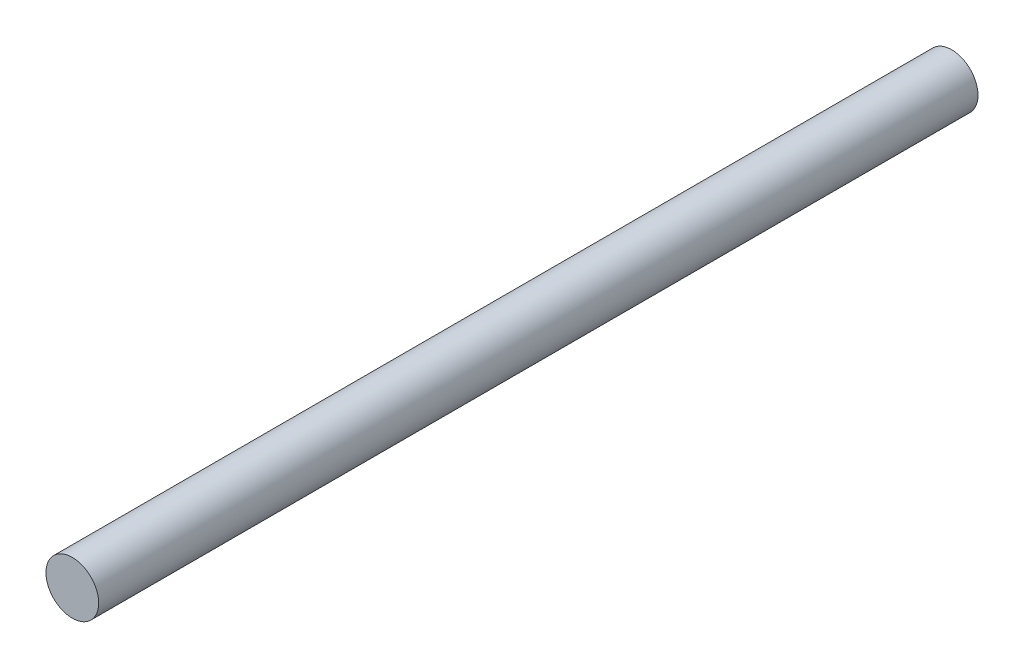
ISO-10303-21;
HEADER;
FILE_DESCRIPTION(('STEP AP214'),'2;1');
FILE_NAME('part.step','',(''),(''),'','','');
FILE_SCHEMA(('AUTOMOTIVE_DESIGN { 1 0 10303 214 1 1 1 1 }'));
ENDSEC;
DATA;
#1=APPLICATION_CONTEXT('core data for automotive mechanical design processes');
#2=APPLICATION_PROTOCOL_DEFINITION('international standard','automotive_design',2000,#1);
#3=PRODUCT_CONTEXT('',#1,'mechanical');
#4=PRODUCT('Part','Part','',(#3));
#5=PRODUCT_RELATED_PRODUCT_CATEGORY('part','',(#4));
#6=PRODUCT_DEFINITION_FORMATION('','',#4);
#7=PRODUCT_DEFINITION_CONTEXT('part definition',#1,'design');
#8=PRODUCT_DEFINITION('design','',#6,#7);
#9=PRODUCT_DEFINITION_SHAPE('','',#8);
#10=(LENGTH_UNIT() NAMED_UNIT(*) SI_UNIT(.MILLI.,.METRE.));
#11=(NAMED_UNIT(*) PLANE_ANGLE_UNIT() SI_UNIT($,.RADIAN.));
#12=(NAMED_UNIT(*) SI_UNIT($,.STERADIAN.) SOLID_ANGLE_UNIT());
#13=UNCERTAINTY_MEASURE_WITH_UNIT(LENGTH_MEASURE(1.E-05),#10,'distance_accuracy_value','');
#14=(GEOMETRIC_REPRESENTATION_CONTEXT(3) GLOBAL_UNCERTAINTY_ASSIGNED_CONTEXT((#13)) GLOBAL_UNIT_ASSIGNED_CONTEXT((#10,
#11,#12)) REPRESENTATION_CONTEXT('',''));
#15=CARTESIAN_POINT('',(0.,0.,0.));
#16=DIRECTION('',(0.,0.,1.));
#17=DIRECTION('',(1.,0.,0.));
#18=AXIS2_PLACEMENT_3D('',#15,#16,#17);
#19=CARTESIAN_POINT('',(0.,0.,133.4));
#20=DIRECTION('',(0.,0.,-1.));
#21=DIRECTION('',(-1.,0.,0.));
#22=AXIS2_PLACEMENT_3D('',#19,#20,#21);
#23=CYLINDRICAL_SURFACE('',#22,4.);
#24=CARTESIAN_POINT('',(0.,0.,133.4));
#25=DIRECTION('',(0.,0.,1.));
#26=DIRECTION('',(1.,0.,0.));
#27=AXIS2_PLACEMENT_3D('',#24,#25,#26);
#28=CIRCLE('',#27,4.);
#29=CARTESIAN_POINT('',(4.,0.,133.4));
#30=VERTEX_POINT('',#29);
#31=EDGE_CURVE('E10',#30,#30,#28,.T.);
#32=ORIENTED_EDGE('',*,*,#31,.F.);
#33=EDGE_LOOP('',(#32));
#34=FACE_BOUND('',#33,.T.);
#35=CARTESIAN_POINT('',(0.,0.,0.));
#36=DIRECTION('',(0.,0.,1.));
#37=DIRECTION('',(1.,0.,0.));
#38=AXIS2_PLACEMENT_3D('',#35,#36,#37);
#39=CIRCLE('',#38,4.);
#40=CARTESIAN_POINT('',(4.,0.,0.));
#41=VERTEX_POINT('',#40);
#42=EDGE_CURVE('E41',#41,#41,#39,.T.);
#43=ORIENTED_EDGE('',*,*,#42,.T.);
#44=EDGE_LOOP('',(#43));
#45=FACE_BOUND('',#44,.T.);
#46=ADVANCED_FACE('F38',(#34,#45),#23,.T.);
#47=CARTESIAN_POINT('',(0.,0.,133.4));
#48=DIRECTION('',(0.,0.,1.));
#49=DIRECTION('',(1.,0.,0.));
#50=AXIS2_PLACEMENT_3D('',#47,#48,#49);
#51=PLANE('',#50);
#52=ORIENTED_EDGE('',*,*,#31,.T.);
#53=EDGE_LOOP('',(#52));
#54=FACE_BOUND('',#53,.T.);
#55=ADVANCED_FACE('F53',(#54),#51,.T.);
#56=CARTESIAN_POINT('',(0.,0.,0.));
#57=DIRECTION('',(0.,0.,1.));
#58=DIRECTION('',(1.,0.,0.));
#59=AXIS2_PLACEMENT_3D('',#56,#57,#58);
#60=PLANE('',#59);
#61=ORIENTED_EDGE('',*,*,#42,.F.);
#62=EDGE_LOOP('',(#61));
#63=FACE_BOUND('',#62,.T.);
#64=ADVANCED_FACE('F51',(#63),#60,.F.);
#65=CLOSED_SHELL('',(#46,#55,#64));
#66=MANIFOLD_SOLID_BREP('B2',#65);
#67=ADVANCED_BREP_SHAPE_REPRESENTATION('',(#18,#66),#14);
#68=SHAPE_DEFINITION_REPRESENTATION(#9,#67);
ENDSEC;
END-ISO-10303-21;
